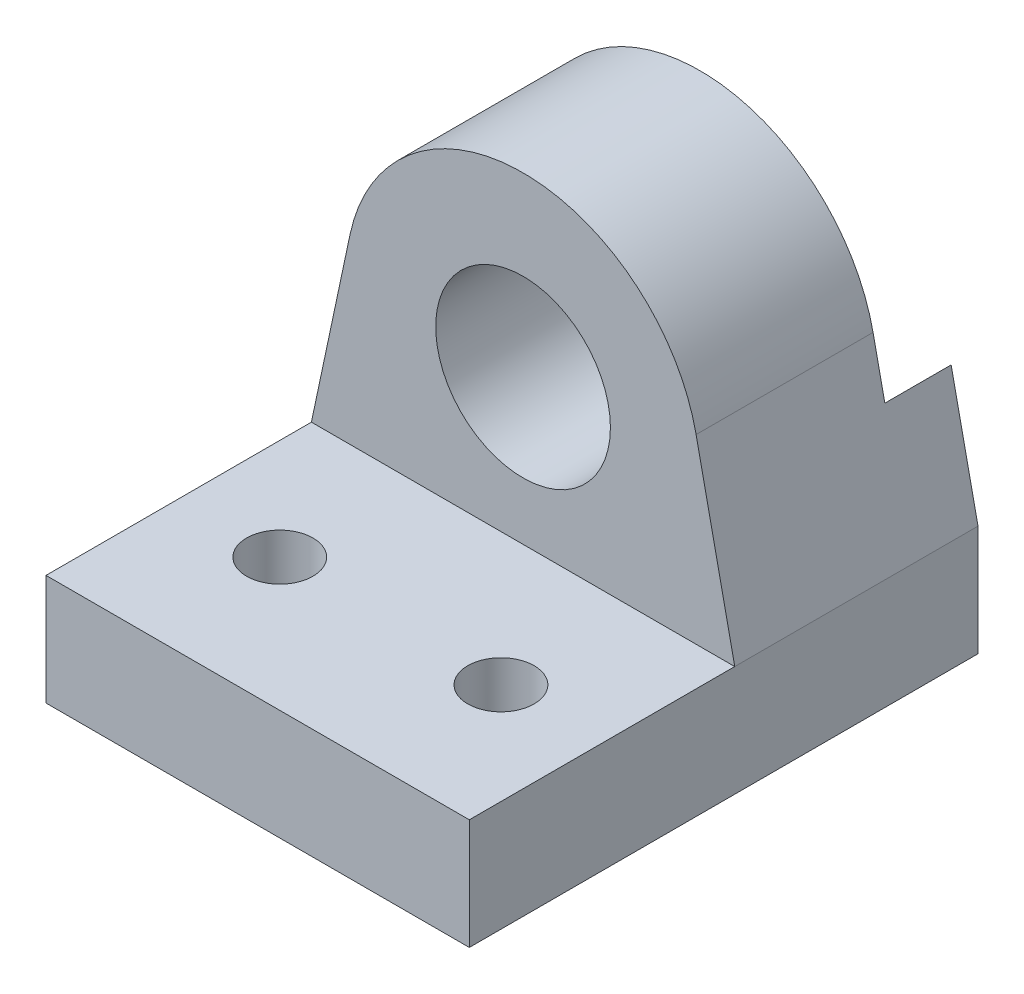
ISO-10303-21;
HEADER;
FILE_DESCRIPTION(('STEP AP214'),'2;1');
FILE_NAME('part.step','',(''),(''),'','','');
FILE_SCHEMA(('AUTOMOTIVE_DESIGN { 1 0 10303 214 1 1 1 1 }'));
ENDSEC;
DATA;
#1=APPLICATION_CONTEXT('core data for automotive mechanical design processes');
#2=APPLICATION_PROTOCOL_DEFINITION('international standard','automotive_design',2000,#1);
#3=PRODUCT_CONTEXT('',#1,'mechanical');
#4=PRODUCT('Part','Part','',(#3));
#5=PRODUCT_RELATED_PRODUCT_CATEGORY('part','',(#4));
#6=PRODUCT_DEFINITION_FORMATION('','',#4);
#7=PRODUCT_DEFINITION_CONTEXT('part definition',#1,'design');
#8=PRODUCT_DEFINITION('design','',#6,#7);
#9=PRODUCT_DEFINITION_SHAPE('','',#8);
#10=(LENGTH_UNIT() NAMED_UNIT(*) SI_UNIT(.MILLI.,.METRE.));
#11=(NAMED_UNIT(*) PLANE_ANGLE_UNIT() SI_UNIT($,.RADIAN.));
#12=(NAMED_UNIT(*) SI_UNIT($,.STERADIAN.) SOLID_ANGLE_UNIT());
#13=UNCERTAINTY_MEASURE_WITH_UNIT(LENGTH_MEASURE(1.E-05),#10,'distance_accuracy_value','');
#14=(GEOMETRIC_REPRESENTATION_CONTEXT(3) GLOBAL_UNCERTAINTY_ASSIGNED_CONTEXT((#13)) GLOBAL_UNIT_ASSIGNED_CONTEXT((#10,
#11,#12)) REPRESENTATION_CONTEXT('',''));
#15=CARTESIAN_POINT('',(0.,0.,0.));
#16=DIRECTION('',(0.,0.,1.));
#17=DIRECTION('',(1.,0.,0.));
#18=AXIS2_PLACEMENT_3D('',#15,#16,#17);
#19=CARTESIAN_POINT('',(0.,0.,0.));
#20=DIRECTION('',(0.,0.,1.));
#21=DIRECTION('',(1.,0.,0.));
#22=AXIS2_PLACEMENT_3D('',#19,#20,#21);
#23=PLANE('',#22);
#24=CARTESIAN_POINT('',(0.,0.,0.));
#25=DIRECTION('',(0.,0.,1.));
#26=DIRECTION('',(1.,0.,0.));
#27=AXIS2_PLACEMENT_3D('',#24,#25,#26);
#28=CIRCLE('',#27,3.95);
#29=CARTESIAN_POINT('',(3.95,0.,0.));
#30=VERTEX_POINT('',#29);
#31=EDGE_CURVE('E199',#30,#30,#28,.T.);
#32=ORIENTED_EDGE('',*,*,#31,.T.);
#33=EDGE_LOOP('',(#32));
#34=FACE_BOUND('',#33,.T.);
#35=DIRECTION('',(0.398828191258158,0.917025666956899,0.));
#36=VECTOR('',#35,1.);
#37=CARTESIAN_POINT('',(7.33620533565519,-3.19062553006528,0.));
#38=LINE('',#37,#36);
#39=CARTESIAN_POINT('',(7.33620533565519,-3.19062553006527,0.));
#40=VERTEX_POINT('',#39);
#41=CARTESIAN_POINT('',(8.35757344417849,-0.842193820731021,0.));
#42=VERTEX_POINT('',#41);
#43=EDGE_CURVE('E54',#40,#42,#38,.T.);
#44=ORIENTED_EDGE('',*,*,#43,.F.);
#45=CARTESIAN_POINT('',(0.,0.,0.));
#46=DIRECTION('',(0.,0.,1.));
#47=DIRECTION('',(-1.,0.,0.));
#48=AXIS2_PLACEMENT_3D('',#45,#46,#47);
#49=CIRCLE('',#48,8.);
#50=CARTESIAN_POINT('',(0.,-8.,0.));
#51=VERTEX_POINT('',#50);
#52=EDGE_CURVE('E148',#51,#40,#49,.T.);
#53=ORIENTED_EDGE('',*,*,#52,.F.);
#54=DIRECTION('',(0.,1.,0.));
#55=VECTOR('',#54,1.);
#56=CARTESIAN_POINT('',(0.,-11.55,0.));
#57=LINE('',#56,#55);
#58=CARTESIAN_POINT('',(0.,-11.55,0.));
#59=VERTEX_POINT('',#58);
#60=EDGE_CURVE('E60',#59,#51,#57,.T.);
#61=ORIENTED_EDGE('',*,*,#60,.F.);
#62=DIRECTION('',(1.,0.,0.));
#63=VECTOR('',#62,1.);
#64=CARTESIAN_POINT('',(-9.57042885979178,-11.55,0.));
#65=LINE('',#64,#63);
#66=CARTESIAN_POINT('',(-9.57042885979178,-11.55,0.));
#67=VERTEX_POINT('',#66);
#68=EDGE_CURVE('E131',#67,#59,#65,.T.);
#69=ORIENTED_EDGE('',*,*,#68,.F.);
#70=DIRECTION('',(0.,1.,0.));
#71=VECTOR('',#70,1.);
#72=CARTESIAN_POINT('',(-9.57042885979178,-11.55,0.));
#73=LINE('',#72,#71);
#74=CARTESIAN_POINT('',(-9.57042885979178,-6.55,0.));
#75=VERTEX_POINT('',#74);
#76=EDGE_CURVE('E192',#67,#75,#73,.T.);
#77=ORIENTED_EDGE('',*,*,#76,.T.);
#78=DIRECTION('',(-0.207850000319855,-0.978160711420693,0.));
#79=VECTOR('',#78,1.);
#80=CARTESIAN_POINT('',(-9.57042885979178,-6.55,0.));
#81=LINE('',#80,#79);
#82=CARTESIAN_POINT('',(-7.82528569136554,1.66280000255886,0.));
#83=VERTEX_POINT('',#82);
#84=EDGE_CURVE('E273',#83,#75,#81,.T.);
#85=ORIENTED_EDGE('',*,*,#84,.F.);
#86=CARTESIAN_POINT('',(0.,0.,0.));
#87=DIRECTION('',(0.,0.,1.));
#88=DIRECTION('',(1.,0.,0.));
#89=AXIS2_PLACEMENT_3D('',#86,#87,#88);
#90=CIRCLE('',#89,8.);
#91=CARTESIAN_POINT('',(7.82528569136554,1.66280000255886,0.));
#92=VERTEX_POINT('',#91);
#93=EDGE_CURVE('E198',#92,#83,#90,.T.);
#94=ORIENTED_EDGE('',*,*,#93,.F.);
#95=DIRECTION('',(-0.207850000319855,0.978160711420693,0.));
#96=VECTOR('',#95,1.);
#97=CARTESIAN_POINT('',(9.57042885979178,-6.55,0.));
#98=LINE('',#97,#96);
#99=EDGE_CURVE('E206',#42,#92,#98,.T.);
#100=ORIENTED_EDGE('',*,*,#99,.F.);
#101=EDGE_LOOP('',(#44,#53,#61,#69,#77,#85,#94,#100));
#102=FACE_BOUND('',#101,.T.);
#103=ADVANCED_FACE('F37',(#34,#102),#23,.F.);
#104=CARTESIAN_POINT('',(0.,0.,8.));
#105=DIRECTION('',(0.,0.,1.));
#106=DIRECTION('',(1.,0.,0.));
#107=AXIS2_PLACEMENT_3D('',#104,#105,#106);
#108=PLANE('',#107);
#109=CARTESIAN_POINT('',(0.,0.,8.));
#110=DIRECTION('',(0.,0.,1.));
#111=DIRECTION('',(1.,0.,0.));
#112=AXIS2_PLACEMENT_3D('',#109,#110,#111);
#113=CIRCLE('',#112,8.);
#114=CARTESIAN_POINT('',(7.82528569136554,1.66280000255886,8.));
#115=VERTEX_POINT('',#114);
#116=CARTESIAN_POINT('',(-7.82528569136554,1.66280000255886,8.));
#117=VERTEX_POINT('',#116);
#118=EDGE_CURVE('E202',#115,#117,#113,.T.);
#119=ORIENTED_EDGE('',*,*,#118,.T.);
#120=DIRECTION('',(-0.207850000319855,-0.978160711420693,0.));
#121=VECTOR('',#120,1.);
#122=CARTESIAN_POINT('',(-9.57042885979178,-6.55,8.));
#123=LINE('',#122,#121);
#124=CARTESIAN_POINT('',(-9.57042885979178,-6.55,8.));
#125=VERTEX_POINT('',#124);
#126=EDGE_CURVE('E205',#117,#125,#123,.T.);
#127=ORIENTED_EDGE('',*,*,#126,.T.);
#128=DIRECTION('',(1.,0.,0.));
#129=VECTOR('',#128,1.);
#130=CARTESIAN_POINT('',(9.57042885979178,-6.55,8.));
#131=LINE('',#130,#129);
#132=CARTESIAN_POINT('',(9.57042885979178,-6.55,8.));
#133=VERTEX_POINT('',#132);
#134=EDGE_CURVE('E211',#125,#133,#131,.T.);
#135=ORIENTED_EDGE('',*,*,#134,.T.);
#136=DIRECTION('',(-0.207850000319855,0.978160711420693,0.));
#137=VECTOR('',#136,1.);
#138=CARTESIAN_POINT('',(9.57042885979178,-6.55,8.));
#139=LINE('',#138,#137);
#140=EDGE_CURVE('E214',#133,#115,#139,.T.);
#141=ORIENTED_EDGE('',*,*,#140,.T.);
#142=EDGE_LOOP('',(#119,#127,#135,#141));
#143=FACE_BOUND('',#142,.T.);
#144=CARTESIAN_POINT('',(0.,0.,8.));
#145=DIRECTION('',(0.,0.,1.));
#146=DIRECTION('',(1.,0.,0.));
#147=AXIS2_PLACEMENT_3D('',#144,#145,#146);
#148=CIRCLE('',#147,3.95);
#149=CARTESIAN_POINT('',(3.95,0.,8.));
#150=VERTEX_POINT('',#149);
#151=EDGE_CURVE('E195',#150,#150,#148,.T.);
#152=ORIENTED_EDGE('',*,*,#151,.F.);
#153=EDGE_LOOP('',(#152));
#154=FACE_BOUND('',#153,.T.);
#155=ADVANCED_FACE('F250',(#143,#154),#108,.T.);
#156=CARTESIAN_POINT('',(0.,0.,8.));
#157=DIRECTION('',(0.,0.,-1.));
#158=DIRECTION('',(-1.,0.,0.));
#159=AXIS2_PLACEMENT_3D('',#156,#157,#158);
#160=CYLINDRICAL_SURFACE('',#159,8.);
#161=ORIENTED_EDGE('',*,*,#93,.T.);
#162=DIRECTION('',(0.,0.,-1.));
#163=VECTOR('',#162,1.);
#164=CARTESIAN_POINT('',(-7.82528569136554,1.66280000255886,8.));
#165=LINE('',#164,#163);
#166=EDGE_CURVE('E11',#117,#83,#165,.T.);
#167=ORIENTED_EDGE('',*,*,#166,.F.);
#168=ORIENTED_EDGE('',*,*,#118,.F.);
#169=DIRECTION('',(0.,0.,-1.));
#170=VECTOR('',#169,1.);
#171=CARTESIAN_POINT('',(7.82528569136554,1.66280000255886,8.));
#172=LINE('',#171,#170);
#173=EDGE_CURVE('E218',#115,#92,#172,.T.);
#174=ORIENTED_EDGE('',*,*,#173,.T.);
#175=EDGE_LOOP('',(#161,#167,#168,#174));
#176=FACE_BOUND('',#175,.T.);
#177=ADVANCED_FACE('F39',(#176),#160,.T.);
#178=CARTESIAN_POINT('',(-9.57042885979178,-6.55,8.));
#179=DIRECTION('',(0.978160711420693,-0.207850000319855,0.));
#180=DIRECTION('',(0.207850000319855,0.978160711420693,0.));
#181=AXIS2_PLACEMENT_3D('',#178,#179,#180);
#182=PLANE('',#181);
#183=ORIENTED_EDGE('',*,*,#84,.T.);
#184=DIRECTION('',(0.,0.,-1.));
#185=VECTOR('',#184,1.);
#186=CARTESIAN_POINT('',(-9.57042885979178,-6.55,8.));
#187=LINE('',#186,#185);
#188=EDGE_CURVE('E46',#125,#75,#187,.T.);
#189=ORIENTED_EDGE('',*,*,#188,.F.);
#190=ORIENTED_EDGE('',*,*,#126,.F.);
#191=ORIENTED_EDGE('',*,*,#166,.T.);
#192=EDGE_LOOP('',(#183,#189,#190,#191));
#193=FACE_BOUND('',#192,.T.);
#194=ADVANCED_FACE('F263',(#193),#182,.F.);
#195=CARTESIAN_POINT('',(9.57042885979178,-6.55,8.));
#196=DIRECTION('',(-0.978160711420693,-0.207850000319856,0.));
#197=DIRECTION('',(0.207850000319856,-0.978160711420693,0.));
#198=AXIS2_PLACEMENT_3D('',#195,#196,#197);
#199=PLANE('',#198);
#200=DIRECTION('',(0.,0.,-1.));
#201=VECTOR('',#200,1.);
#202=CARTESIAN_POINT('',(9.57042885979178,-6.55,8.));
#203=LINE('',#202,#201);
#204=CARTESIAN_POINT('',(9.57042885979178,-6.55000000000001,-3.));
#205=VERTEX_POINT('',#204);
#206=EDGE_CURVE('E216',#133,#205,#203,.T.);
#207=ORIENTED_EDGE('',*,*,#206,.T.);
#208=DIRECTION('',(0.207850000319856,-0.978160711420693,0.));
#209=VECTOR('',#208,1.);
#210=CARTESIAN_POINT('',(8.35757344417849,-0.842193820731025,-3.));
#211=LINE('',#210,#209);
#212=CARTESIAN_POINT('',(8.35757344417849,-0.842193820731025,-3.));
#213=VERTEX_POINT('',#212);
#214=EDGE_CURVE('E146',#213,#205,#211,.T.);
#215=ORIENTED_EDGE('',*,*,#214,.F.);
#216=DIRECTION('',(0.,0.,1.));
#217=VECTOR('',#216,1.);
#218=CARTESIAN_POINT('',(8.35757344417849,-0.842193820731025,-3.));
#219=LINE('',#218,#217);
#220=EDGE_CURVE('E157',#213,#42,#219,.T.);
#221=ORIENTED_EDGE('',*,*,#220,.T.);
#222=ORIENTED_EDGE('',*,*,#99,.T.);
#223=ORIENTED_EDGE('',*,*,#173,.F.);
#224=ORIENTED_EDGE('',*,*,#140,.F.);
#225=EDGE_LOOP('',(#207,#215,#221,#222,#223,#224));
#226=FACE_BOUND('',#225,.T.);
#227=ADVANCED_FACE('F260',(#226),#199,.F.);
#228=CARTESIAN_POINT('',(0.,0.,8.));
#229=DIRECTION('',(0.,0.,-1.));
#230=DIRECTION('',(-1.,0.,0.));
#231=AXIS2_PLACEMENT_3D('',#228,#229,#230);
#232=CYLINDRICAL_SURFACE('',#231,3.95);
#233=ORIENTED_EDGE('',*,*,#151,.T.);
#234=EDGE_LOOP('',(#233));
#235=FACE_BOUND('',#234,.T.);
#236=ORIENTED_EDGE('',*,*,#31,.F.);
#237=EDGE_LOOP('',(#236));
#238=FACE_BOUND('',#237,.T.);
#239=ADVANCED_FACE('F262',(#235,#238),#232,.F.);
#240=CARTESIAN_POINT('',(0.,-6.55,0.));
#241=DIRECTION('',(0.,1.,0.));
#242=DIRECTION('',(-1.,0.,0.));
#243=AXIS2_PLACEMENT_3D('',#240,#241,#242);
#244=PLANE('',#243);
#245=CARTESIAN_POINT('',(5.,-6.55,14.));
#246=DIRECTION('',(0.,1.,0.));
#247=DIRECTION('',(1.,0.,0.));
#248=AXIS2_PLACEMENT_3D('',#245,#246,#247);
#249=CIRCLE('',#248,1.5);
#250=CARTESIAN_POINT('',(6.5,-6.55,14.));
#251=VERTEX_POINT('',#250);
#252=EDGE_CURVE('E169',#251,#251,#249,.T.);
#253=ORIENTED_EDGE('',*,*,#252,.F.);
#254=EDGE_LOOP('',(#253));
#255=FACE_BOUND('',#254,.T.);
#256=CARTESIAN_POINT('',(-5.,-6.55,14.));
#257=DIRECTION('',(0.,1.,0.));
#258=DIRECTION('',(-1.,0.,0.));
#259=AXIS2_PLACEMENT_3D('',#256,#257,#258);
#260=CIRCLE('',#259,1.5);
#261=CARTESIAN_POINT('',(-6.5,-6.55,14.));
#262=VERTEX_POINT('',#261);
#263=EDGE_CURVE('E172',#262,#262,#260,.T.);
#264=ORIENTED_EDGE('',*,*,#263,.F.);
#265=EDGE_LOOP('',(#264));
#266=FACE_BOUND('',#265,.T.);
#267=ORIENTED_EDGE('',*,*,#134,.F.);
#268=DIRECTION('',(0.,0.,-1.));
#269=VECTOR('',#268,1.);
#270=CARTESIAN_POINT('',(-9.57042885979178,-6.55,0.));
#271=LINE('',#270,#269);
#272=CARTESIAN_POINT('',(-9.57042885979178,-6.55,20.));
#273=VERTEX_POINT('',#272);
#274=EDGE_CURVE('E187',#273,#125,#271,.T.);
#275=ORIENTED_EDGE('',*,*,#274,.F.);
#276=DIRECTION('',(-1.,0.,0.));
#277=VECTOR('',#276,1.);
#278=CARTESIAN_POINT('',(-9.57042885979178,-6.55,20.));
#279=LINE('',#278,#277);
#280=CARTESIAN_POINT('',(9.57042885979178,-6.55,20.));
#281=VERTEX_POINT('',#280);
#282=EDGE_CURVE('E178',#281,#273,#279,.T.);
#283=ORIENTED_EDGE('',*,*,#282,.F.);
#284=DIRECTION('',(0.,0.,1.));
#285=VECTOR('',#284,1.);
#286=CARTESIAN_POINT('',(9.57042885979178,-6.55,0.));
#287=LINE('',#286,#285);
#288=EDGE_CURVE('E191',#133,#281,#287,.T.);
#289=ORIENTED_EDGE('',*,*,#288,.F.);
#290=EDGE_LOOP('',(#267,#275,#283,#289));
#291=FACE_BOUND('',#290,.T.);
#292=ADVANCED_FACE('F291',(#255,#266,#291),#244,.T.);
#293=CARTESIAN_POINT('',(-9.57042885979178,-11.55,0.));
#294=DIRECTION('',(1.,0.,0.));
#295=DIRECTION('',(0.,1.,0.));
#296=AXIS2_PLACEMENT_3D('',#293,#294,#295);
#297=PLANE('',#296);
#298=ORIENTED_EDGE('',*,*,#274,.T.);
#299=ORIENTED_EDGE('',*,*,#188,.T.);
#300=ORIENTED_EDGE('',*,*,#76,.F.);
#301=DIRECTION('',(0.,0.,-1.));
#302=VECTOR('',#301,1.);
#303=CARTESIAN_POINT('',(-9.57042885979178,-11.55,0.));
#304=LINE('',#303,#302);
#305=CARTESIAN_POINT('',(-9.57042885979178,-11.55,20.));
#306=VERTEX_POINT('',#305);
#307=EDGE_CURVE('E176',#306,#67,#304,.T.);
#308=ORIENTED_EDGE('',*,*,#307,.F.);
#309=DIRECTION('',(0.,1.,0.));
#310=VECTOR('',#309,1.);
#311=CARTESIAN_POINT('',(-9.57042885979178,-11.55,20.));
#312=LINE('',#311,#310);
#313=EDGE_CURVE('E181',#306,#273,#312,.T.);
#314=ORIENTED_EDGE('',*,*,#313,.T.);
#315=EDGE_LOOP('',(#298,#299,#300,#308,#314));
#316=FACE_BOUND('',#315,.T.);
#317=ADVANCED_FACE('F302',(#316),#297,.F.);
#318=CARTESIAN_POINT('',(9.57042885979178,-11.55,0.));
#319=DIRECTION('',(-1.,0.,0.));
#320=DIRECTION('',(0.,-1.,0.));
#321=AXIS2_PLACEMENT_3D('',#318,#319,#320);
#322=PLANE('',#321);
#323=ORIENTED_EDGE('',*,*,#206,.F.);
#324=ORIENTED_EDGE('',*,*,#288,.T.);
#325=DIRECTION('',(0.,1.,0.));
#326=VECTOR('',#325,1.);
#327=CARTESIAN_POINT('',(9.57042885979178,-11.55,20.));
#328=LINE('',#327,#326);
#329=CARTESIAN_POINT('',(9.57042885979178,-11.55,20.));
#330=VERTEX_POINT('',#329);
#331=EDGE_CURVE('E127',#330,#281,#328,.T.);
#332=ORIENTED_EDGE('',*,*,#331,.F.);
#333=DIRECTION('',(0.,0.,1.));
#334=VECTOR('',#333,1.);
#335=CARTESIAN_POINT('',(9.57042885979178,-11.55,0.));
#336=LINE('',#335,#334);
#337=CARTESIAN_POINT('',(9.57042885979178,-11.55,-3.));
#338=VERTEX_POINT('',#337);
#339=EDGE_CURVE('E121',#338,#330,#336,.T.);
#340=ORIENTED_EDGE('',*,*,#339,.F.);
#341=DIRECTION('',(0.,-1.,0.));
#342=VECTOR('',#341,1.);
#343=CARTESIAN_POINT('',(9.57042885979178,-6.55000000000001,-3.));
#344=LINE('',#343,#342);
#345=EDGE_CURVE('E125',#205,#338,#344,.T.);
#346=ORIENTED_EDGE('',*,*,#345,.F.);
#347=EDGE_LOOP('',(#323,#324,#332,#340,#346));
#348=FACE_BOUND('',#347,.T.);
#349=ADVANCED_FACE('F123',(#348),#322,.F.);
#350=CARTESIAN_POINT('',(-9.57042885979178,-11.55,20.));
#351=DIRECTION('',(0.,0.,-1.));
#352=DIRECTION('',(-1.,0.,0.));
#353=AXIS2_PLACEMENT_3D('',#350,#351,#352);
#354=PLANE('',#353);
#355=ORIENTED_EDGE('',*,*,#282,.T.);
#356=ORIENTED_EDGE('',*,*,#313,.F.);
#357=DIRECTION('',(-1.,0.,0.));
#358=VECTOR('',#357,1.);
#359=CARTESIAN_POINT('',(-9.57042885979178,-11.55,20.));
#360=LINE('',#359,#358);
#361=EDGE_CURVE('E130',#330,#306,#360,.T.);
#362=ORIENTED_EDGE('',*,*,#361,.F.);
#363=ORIENTED_EDGE('',*,*,#331,.T.);
#364=EDGE_LOOP('',(#355,#356,#362,#363));
#365=FACE_BOUND('',#364,.T.);
#366=ADVANCED_FACE('F246',(#365),#354,.F.);
#367=CARTESIAN_POINT('',(0.,-11.55,0.));
#368=DIRECTION('',(0.,1.,0.));
#369=DIRECTION('',(-1.,0.,0.));
#370=AXIS2_PLACEMENT_3D('',#367,#368,#369);
#371=PLANE('',#370);
#372=CARTESIAN_POINT('',(5.,-11.55,14.));
#373=DIRECTION('',(0.,1.,0.));
#374=DIRECTION('',(-1.,0.,0.));
#375=AXIS2_PLACEMENT_3D('',#372,#373,#374);
#376=CIRCLE('',#375,1.5);
#377=CARTESIAN_POINT('',(3.5,-11.55,14.));
#378=VERTEX_POINT('',#377);
#379=EDGE_CURVE('E41',#378,#378,#376,.T.);
#380=ORIENTED_EDGE('',*,*,#379,.T.);
#381=EDGE_LOOP('',(#380));
#382=FACE_BOUND('',#381,.T.);
#383=CARTESIAN_POINT('',(-5.,-11.55,14.));
#384=DIRECTION('',(0.,1.,0.));
#385=DIRECTION('',(-1.,0.,0.));
#386=AXIS2_PLACEMENT_3D('',#383,#384,#385);
#387=CIRCLE('',#386,1.5);
#388=CARTESIAN_POINT('',(-6.5,-11.55,14.));
#389=VERTEX_POINT('',#388);
#390=EDGE_CURVE('E175',#389,#389,#387,.T.);
#391=ORIENTED_EDGE('',*,*,#390,.T.);
#392=EDGE_LOOP('',(#391));
#393=FACE_BOUND('',#392,.T.);
#394=ORIENTED_EDGE('',*,*,#307,.T.);
#395=ORIENTED_EDGE('',*,*,#68,.T.);
#396=DIRECTION('',(0.,0.,1.));
#397=VECTOR('',#396,1.);
#398=CARTESIAN_POINT('',(0.,-11.55,-3.));
#399=LINE('',#398,#397);
#400=CARTESIAN_POINT('',(0.,-11.55,-3.));
#401=VERTEX_POINT('',#400);
#402=EDGE_CURVE('E138',#401,#59,#399,.T.);
#403=ORIENTED_EDGE('',*,*,#402,.F.);
#404=DIRECTION('',(-1.,0.,0.));
#405=VECTOR('',#404,1.);
#406=CARTESIAN_POINT('',(0.,-11.55,-3.));
#407=LINE('',#406,#405);
#408=EDGE_CURVE('E134',#338,#401,#407,.T.);
#409=ORIENTED_EDGE('',*,*,#408,.F.);
#410=ORIENTED_EDGE('',*,*,#339,.T.);
#411=ORIENTED_EDGE('',*,*,#361,.T.);
#412=EDGE_LOOP('',(#394,#395,#403,#409,#410,#411));
#413=FACE_BOUND('',#412,.T.);
#414=ADVANCED_FACE('F136',(#382,#393,#413),#371,.F.);
#415=CARTESIAN_POINT('',(-5.,-14.55,14.));
#416=DIRECTION('',(0.,1.,0.));
#417=DIRECTION('',(-1.,0.,0.));
#418=AXIS2_PLACEMENT_3D('',#415,#416,#417);
#419=CYLINDRICAL_SURFACE('',#418,1.5);
#420=ORIENTED_EDGE('',*,*,#263,.T.);
#421=EDGE_LOOP('',(#420));
#422=FACE_BOUND('',#421,.T.);
#423=ORIENTED_EDGE('',*,*,#390,.F.);
#424=EDGE_LOOP('',(#423));
#425=FACE_BOUND('',#424,.T.);
#426=ADVANCED_FACE('F234',(#422,#425),#419,.F.);
#427=CARTESIAN_POINT('',(5.,-14.55,14.));
#428=DIRECTION('',(0.,1.,0.));
#429=DIRECTION('',(-1.,0.,0.));
#430=AXIS2_PLACEMENT_3D('',#427,#428,#429);
#431=CYLINDRICAL_SURFACE('',#430,1.5);
#432=ORIENTED_EDGE('',*,*,#252,.T.);
#433=EDGE_LOOP('',(#432));
#434=FACE_BOUND('',#433,.T.);
#435=ORIENTED_EDGE('',*,*,#379,.F.);
#436=EDGE_LOOP('',(#435));
#437=FACE_BOUND('',#436,.T.);
#438=ADVANCED_FACE('F236',(#434,#437),#431,.F.);
#439=CARTESIAN_POINT('',(0.,-11.55,-3.));
#440=DIRECTION('',(1.,0.,0.));
#441=DIRECTION('',(0.,0.,-1.));
#442=AXIS2_PLACEMENT_3D('',#439,#440,#441);
#443=PLANE('',#442);
#444=ORIENTED_EDGE('',*,*,#60,.T.);
#445=DIRECTION('',(0.,0.,1.));
#446=VECTOR('',#445,1.);
#447=CARTESIAN_POINT('',(0.,-8.,-3.));
#448=LINE('',#447,#446);
#449=CARTESIAN_POINT('',(0.,-8.,-3.));
#450=VERTEX_POINT('',#449);
#451=EDGE_CURVE('E165',#450,#51,#448,.T.);
#452=ORIENTED_EDGE('',*,*,#451,.F.);
#453=DIRECTION('',(0.,1.,0.));
#454=VECTOR('',#453,1.);
#455=CARTESIAN_POINT('',(0.,-11.55,-3.));
#456=LINE('',#455,#454);
#457=EDGE_CURVE('E141',#401,#450,#456,.T.);
#458=ORIENTED_EDGE('',*,*,#457,.F.);
#459=ORIENTED_EDGE('',*,*,#402,.T.);
#460=EDGE_LOOP('',(#444,#452,#458,#459));
#461=FACE_BOUND('',#460,.T.);
#462=ADVANCED_FACE('F243',(#461),#443,.F.);
#463=CARTESIAN_POINT('',(0.,0.,-3.));
#464=DIRECTION('',(0.,0.,1.));
#465=DIRECTION('',(1.,0.,0.));
#466=AXIS2_PLACEMENT_3D('',#463,#464,#465);
#467=CYLINDRICAL_SURFACE('',#466,8.);
#468=ORIENTED_EDGE('',*,*,#52,.T.);
#469=DIRECTION('',(0.,0.,1.));
#470=VECTOR('',#469,1.);
#471=CARTESIAN_POINT('',(7.33620533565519,-3.19062553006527,-3.));
#472=LINE('',#471,#470);
#473=CARTESIAN_POINT('',(7.33620533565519,-3.19062553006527,-3.));
#474=VERTEX_POINT('',#473);
#475=EDGE_CURVE('E162',#474,#40,#472,.T.);
#476=ORIENTED_EDGE('',*,*,#475,.F.);
#477=CARTESIAN_POINT('',(0.,0.,-3.));
#478=DIRECTION('',(0.,0.,1.));
#479=DIRECTION('',(-1.,0.,0.));
#480=AXIS2_PLACEMENT_3D('',#477,#478,#479);
#481=CIRCLE('',#480,8.);
#482=EDGE_CURVE('E152',#450,#474,#481,.T.);
#483=ORIENTED_EDGE('',*,*,#482,.F.);
#484=ORIENTED_EDGE('',*,*,#451,.T.);
#485=EDGE_LOOP('',(#468,#476,#483,#484));
#486=FACE_BOUND('',#485,.T.);
#487=ADVANCED_FACE('F324',(#486),#467,.F.);
#488=CARTESIAN_POINT('',(7.33620533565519,-3.19062553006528,-3.));
#489=DIRECTION('',(0.917025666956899,-0.398828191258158,0.));
#490=DIRECTION('',(0.398828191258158,0.917025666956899,0.));
#491=AXIS2_PLACEMENT_3D('',#488,#489,#490);
#492=PLANE('',#491);
#493=ORIENTED_EDGE('',*,*,#43,.T.);
#494=ORIENTED_EDGE('',*,*,#220,.F.);
#495=DIRECTION('',(0.398828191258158,0.917025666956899,0.));
#496=VECTOR('',#495,1.);
#497=CARTESIAN_POINT('',(7.33620533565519,-3.19062553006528,-3.));
#498=LINE('',#497,#496);
#499=EDGE_CURVE('E154',#474,#213,#498,.T.);
#500=ORIENTED_EDGE('',*,*,#499,.F.);
#501=ORIENTED_EDGE('',*,*,#475,.T.);
#502=EDGE_LOOP('',(#493,#494,#500,#501));
#503=FACE_BOUND('',#502,.T.);
#504=ADVANCED_FACE('F285',(#503),#492,.F.);
#505=CARTESIAN_POINT('',(0.,0.,-3.));
#506=DIRECTION('',(0.,0.,-1.));
#507=DIRECTION('',(-1.,0.,0.));
#508=AXIS2_PLACEMENT_3D('',#505,#506,#507);
#509=PLANE('',#508);
#510=ORIENTED_EDGE('',*,*,#345,.T.);
#511=ORIENTED_EDGE('',*,*,#408,.T.);
#512=ORIENTED_EDGE('',*,*,#457,.T.);
#513=ORIENTED_EDGE('',*,*,#482,.T.);
#514=ORIENTED_EDGE('',*,*,#499,.T.);
#515=ORIENTED_EDGE('',*,*,#214,.T.);
#516=EDGE_LOOP('',(#510,#511,#512,#513,#514,#515));
#517=FACE_BOUND('',#516,.T.);
#518=ADVANCED_FACE('F144',(#517),#509,.T.);
#519=CLOSED_SHELL('',(#103,#155,#177,#194,#227,#239,#292,#317,#349,#366,#414,#426,#438,#462,
#487,#504,#518));
#520=MANIFOLD_SOLID_BREP('B2',#519);
#521=ADVANCED_BREP_SHAPE_REPRESENTATION('',(#18,#520),#14);
#522=SHAPE_DEFINITION_REPRESENTATION(#9,#521);
ENDSEC;
END-ISO-10303-21;
